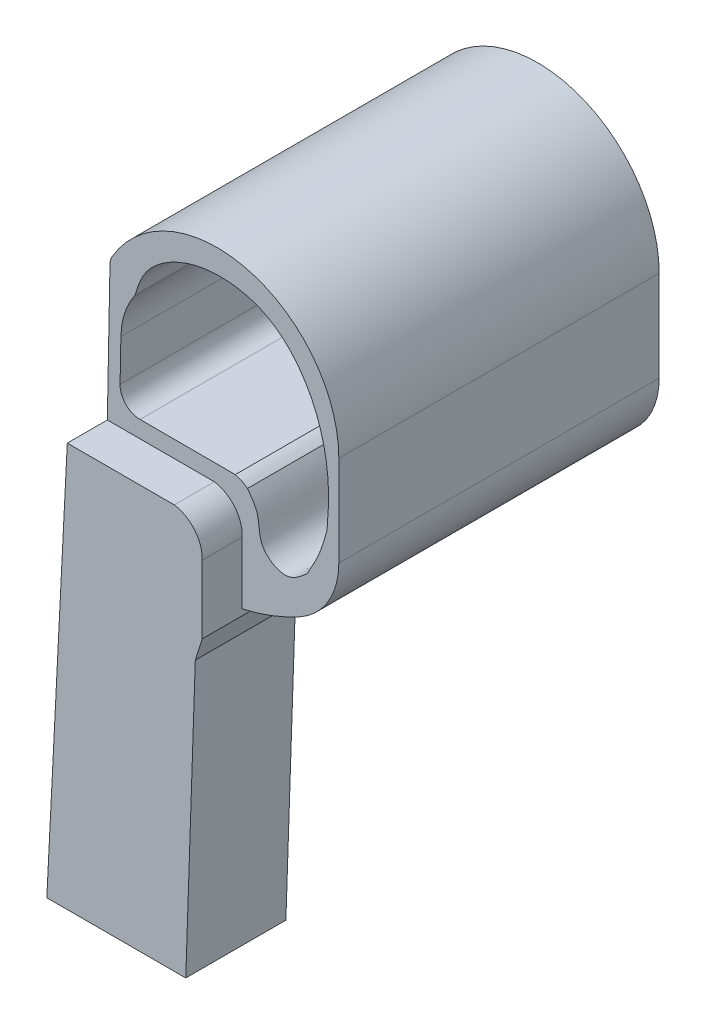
from build123d import *

# Parameters (mm, degrees)
LINEAR_AUSTRAGEN2_DEPTH         = 65
SCHNITT_LINEAR_AUSTRAGEN2_DEPTH = 62
SCHNITT_LINEAR_AUSTRAGEN3_REACH = 93.188
SKIZZE12_W                      = 18.309748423
SKIZZE12_H                      = 27
LINEAR_AUSTRAGEN7_DEPTH         = 25
LINEAR_START                    = 15
LINEAR_AUSTRAGEN8_DEPTH         = 15


with BuildPart() as part:
    # Skizze4 → Linear austragen2 (new body)
    with BuildSketch(Plane.XY):
        with BuildLine():
            Line((-12.196660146, 51.424572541), (-13.153946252, 51.424572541))
            ThreePointArc((-13.153946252, 51.424572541), (-13.867859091, 51.724337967), (-14.153759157, 52.443915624))
            Line((-14.153759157, 52.443915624), (-13.476624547, 87.443915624))
            ThreePointArc((-13.476624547, 87.443915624), (-13.327820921, 88.450079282), (-12.930059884, 89.386185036))
            ThreePointArc((-12.930059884, 89.386185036), (21.23901352, 103.369260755), (43.67259117, 74.047143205))
            Line((43.67259117, 74.047143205), (43.67259117, 51.376827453))
            ThreePointArc((43.67259117, 51.376827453), (41.077889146, 41.84280509), (34.009496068, 34.938612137))
            ThreePointArc((34.009496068, 34.938612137), (26.977055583, 31.657325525), (19.549379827, 29.409728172))
            Line((19.549379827, 29.409728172), (19.549379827, 44.901798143))
            ThreePointArc((19.549379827, 44.901798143), (17.706703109, 50.493550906), (12.59926046, 53.422234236))
            Line((12.59926046, 53.422234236), (-8.771067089, 53.422234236))
            ThreePointArc((-8.771067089, 53.422234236), (-10.634182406, 52.681170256), (-12.196660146, 51.424572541))
        make_face()
    extrude(amount=-LINEAR_AUSTRAGEN2_DEPTH)

    # Skizze8 → Schnitt-Linear austragen2 (cut)
    with BuildSketch(Plane.XY):
        with BuildLine():
            Line((-10.753099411, 73.124356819), (-10.954418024, 62.718521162))
            ThreePointArc((-10.954418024, 62.718521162), (-9.527991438, 59.123769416), (-5.964136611, 57.621813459))
            Line((-5.964136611, 57.621813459), (17.80776253, 57.580055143))
            add(Edge.make_bspline(
                [(17.80776253, 57.580055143), (18.222895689, 57.465583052), (19.326474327, 57.161273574), (20.285457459, 56.527615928), (20.883699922, 56.132321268)],
                knots=[0, 0, 0, 0, 0.376169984, 1, 1, 1, 1], degree=3))
            add(Edge.make_bspline(
                [(20.883699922, 56.132321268), (21.873041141, 54.766234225), (24.130901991, 51.648569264), (23.277117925, 45.071189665), (30.548419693, 40.549051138), (34.097423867, 43.663288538), (35.770643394, 45.131532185)],
                knots=[0, 0, 0, 0, 0.203298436, 0.463964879, 0.747279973, 1, 1, 1, 1], degree=3))
            add(Edge.make_bspline(
                [(40.720192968, 56.961047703), (40.166671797, 54.984361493), (39.005800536, 50.83875997), (36.881857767, 47.091855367), (35.770643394, 45.131532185)],
                knots=[0, 0, 0, 0, 0.476815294, 1, 1, 1, 1], degree=3))
            add(Edge.make_bspline(
                [(-7.251570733, 83.830863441), (-6.64345627, 85.739672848), (-4.833818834, 91.419940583), (3.47390008, 97.23863891), (14.697379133, 99.273808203), (26.368453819, 96.774263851), (34.770159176, 88.366304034), (39.845701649, 77.53708589), (41.473659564, 66.840972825), (40.926541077, 59.666813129), (40.720192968, 56.961047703)],
                knots=[0.004715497, 0.004715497, 0.004715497, 0.004715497, 0.075334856, 0.214865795, 0.335972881, 0.479689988, 0.620641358, 0.743144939, 0.903126, 1, 1, 1, 1], degree=3))
            ThreePointArc((-7.251570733, 83.830863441), (-9.802471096, 78.739292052), (-10.753099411, 73.124356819))
        make_face()
    extrude(amount=-SCHNITT_LINEAR_AUSTRAGEN2_DEPTH, mode=Mode.SUBTRACT)

    # Skizze12 → Schnitt-Linear austragen3 (cut, up to next)
    with BuildSketch(Plane(origin=(0.10120121, 57.611158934, 0), x_dir=(0.9999984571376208, -0.0017566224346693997, 0), z_dir=(0.0017566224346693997, 0.9999984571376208, 0)), mode=Mode.PRIVATE) as schnitt_linear_austragen3_sk1:
        with Locations((3.910434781, 48.5)):
            Rectangle(SKIZZE12_W, SKIZZE12_H)
    schnitt_linear_austragen3_tool1 = extrude(schnitt_linear_austragen3_sk1.sketch, amount=-SCHNITT_LINEAR_AUSTRAGEN3_REACH, mode=Mode.PRIVATE) & part.part
    add(schnitt_linear_austragen3_tool1.solids().sort_by_distance((4.01163, 57.60429, -48.5))[0], mode=Mode.SUBTRACT)



with BuildPart() as body_2:
    # Skizze13 → Linear austragen7 (new body)
    with BuildSketch(Plane.XY):
        with BuildLine():
            Line((-19.249804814, -47.463982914), (15.45179628, -47.463982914))
            Line((15.45179628, -47.463982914), (17.830306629, 22.464651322))
            Line((17.830306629, 22.464651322), (19.549379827, 27.920910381))
            Line((19.549379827, 27.920910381), (19.549379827, 44.901798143))
            ThreePointArc((19.549379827, 44.901798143), (17.706703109, 50.493550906), (12.59926046, 53.422234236))
            Line((12.59926046, 53.422234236), (-14.134831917, 53.422234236))
            Line((-14.134831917, 53.422234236), (-19.249804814, -47.463982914))
        make_face()
    extrude(amount=LINEAR_AUSTRAGEN7_DEPTH)


with BuildPart() as part_1:
    add(part.part)

    add(body_2.part)  # Linear austragen8 merges body 2
    # Skizze14 → Linear austragen8 (add)
    with BuildSketch(Plane.XY.offset(LINEAR_START)):
        with BuildLine():
            Line((43.67259117, 51.376827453), (43.67259117, 74.047143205))
            ThreePointArc((43.67259117, 74.047143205), (21.23901352, 103.369260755), (-12.930059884, 89.386185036))
            ThreePointArc((-12.930059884, 89.386185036), (-13.327820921, 88.450079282), (-13.476624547, 87.443915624))
            Line((-13.476624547, 87.443915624), (-14.153759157, 52.443915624))
            ThreePointArc((-14.153759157, 52.443915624), (-13.867859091, 51.724337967), (-13.153946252, 51.424572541))
            Line((-13.153946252, 51.424572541), (-12.196660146, 51.424572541))
            ThreePointArc((-12.196660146, 51.424572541), (-10.634182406, 52.681170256), (-8.771067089, 53.422234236))
            Line((-8.771067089, 53.422234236), (12.59926046, 53.422234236))
            ThreePointArc((12.59926046, 53.422234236), (17.706703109, 50.493550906), (19.549379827, 44.901798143))
            Line((19.549379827, 44.901798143), (19.549379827, 29.409728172))
            ThreePointArc((19.549379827, 29.409728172), (26.977055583, 31.657325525), (34.009496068, 34.938612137))
            ThreePointArc((34.009496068, 34.938612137), (41.077889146, 41.84280509), (43.67259117, 51.376827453))
        make_face()
        with BuildLine():
            Line((-5.964136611, 57.621813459), (17.80776253, 57.580055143))
            add(Edge.make_bspline(
                [(17.80776253, 57.580055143), (18.222895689, 57.465583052), (19.326474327, 57.161273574), (20.285457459, 56.527615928), (20.883699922, 56.132321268)],
                knots=[0, 0, 0, 0, 0.376169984, 1, 1, 1, 1], degree=3))
            add(Edge.make_bspline(
                [(20.883699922, 56.132321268), (21.873041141, 54.766234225), (24.130901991, 51.648569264), (23.277117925, 45.071189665), (30.548419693, 40.549051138), (34.097423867, 43.663288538), (35.770643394, 45.131532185)],
                knots=[0, 0, 0, 0, 0.203298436, 0.463964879, 0.747279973, 1, 1, 1, 1], degree=3))
            add(Edge.make_bspline(
                [(35.770643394, 45.131532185), (36.881857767, 47.091855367), (39.005800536, 50.83875997), (40.166671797, 54.984361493), (40.720192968, 56.961047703)],
                knots=[0, 0, 0, 0, 0.523184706, 1, 1, 1, 1], degree=3))
            add(Edge.make_bspline(
                [(40.720192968, 56.961047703), (40.926541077, 59.666813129), (41.473659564, 66.840972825), (39.845701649, 77.53708589), (34.770159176, 88.366304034), (26.368453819, 96.774263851), (14.697379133, 99.273808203), (3.47390008, 97.23863891), (-4.833818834, 91.419940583), (-6.64345627, 85.739672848), (-7.251570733, 83.830863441)],
                knots=[0.004715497, 0.004715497, 0.004715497, 0.004715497, 0.101589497, 0.261570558, 0.384074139, 0.525025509, 0.668742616, 0.789849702, 0.929380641, 1, 1, 1, 1], degree=3))
            ThreePointArc((-7.251570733, 83.830863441), (-9.802471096, 78.739292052), (-10.753099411, 73.124356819))
            Line((-10.753099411, 73.124356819), (-10.954418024, 62.718521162))
            ThreePointArc((-10.954418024, 62.718521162), (-9.527991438, 59.123769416), (-5.964136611, 57.621813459))
        make_face(mode=Mode.SUBTRACT)
    extrude(amount=-LINEAR_AUSTRAGEN8_DEPTH)


solid = part_1.part
